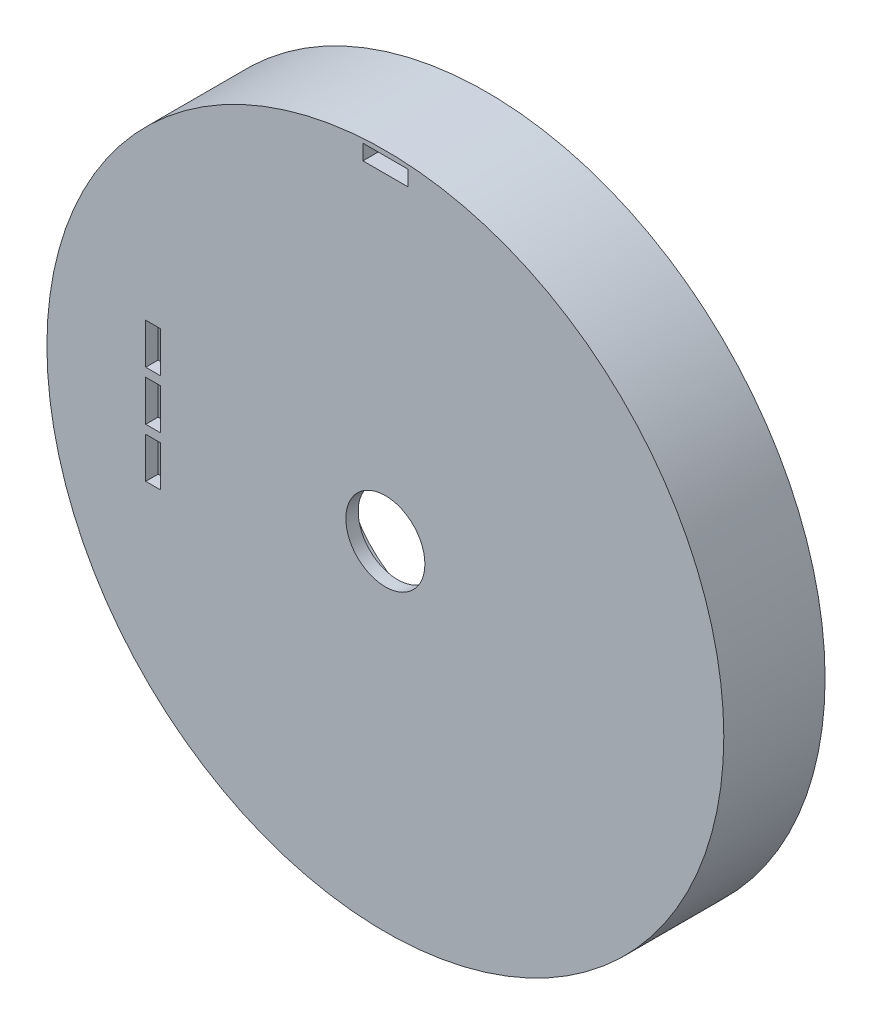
from build123d import *

# Parameters (mm, degrees)
SKICA1_R                      = 137
SKICA1_R_2                    = 16
P_IDAT_VYSUNUT_M1_DEPTH       = 5
P_IDAT_START                  = 36
SKICA4_R                      = 137
SKICA4_R_2                    = 122.5
P_IDAT_VYSUNUT_M2_DEPTH       = 36
ODEBRAT_VYSUNUT_M3_DEPTH      = 33.7
ODEBRAT_VYSUNUT_M3_DEPTH_BACK = 73.7
SKICA7_W                      = 18.14
SKICA7_H                      = 6.19
SKICA10_W                     = 6
SKICA10_H                     = 16.5
ODEBRAT_VYSUNUT_M4_DEPTH      = 30
P_IDAT_START_2                = 4.70229
SKICA11_R                     = 126.5
SKICA11_R_2                   = 122.5
P_IDAT_VYSUNUT_M3_DEPTH       = 4.70229
SKICA12_R                     = 45
SKICA12_R_2                   = 40
P_IDAT_VYSUNUT_M4_DEPTH       = 18
M_TKO1_SCALE                  = 0.655


with BuildPart() as part:
    # Skica1 → P_idat vysunut_m1 (new body)
    with BuildSketch(Plane.XY):
        Circle(SKICA1_R)
        Circle(SKICA1_R_2, mode=Mode.SUBTRACT)
    extrude(amount=P_IDAT_VYSUNUT_M1_DEPTH)

    # Skica4 → P_idat vysunut_m2 (add)
    with BuildSketch(Plane(origin=(0, 0, 0), x_dir=(-1, 0, 0), z_dir=(0, 0, -1)).offset(P_IDAT_START)):
        Circle(SKICA4_R)
        Circle(SKICA4_R_2, mode=Mode.SUBTRACT)
    extrude(amount=-P_IDAT_VYSUNUT_M2_DEPTH)

    # Skica7 → Odebrat vysunut_m3 (cut, two sides: drawn at the far end of the back side and taken through both)
    with BuildSketch(Plane.XY.offset(-ODEBRAT_VYSUNUT_M3_DEPTH_BACK)):
        with Locations((0, 131.905)):
            Rectangle(SKICA7_W, SKICA7_H)
    extrude(amount=ODEBRAT_VYSUNUT_M3_DEPTH + ODEBRAT_VYSUNUT_M3_DEPTH_BACK, mode=Mode.SUBTRACT)

    # Skica10 → Odebrat vysunut_m4 (cut)
    with BuildSketch(Plane.XY.offset(5)):
        with Locations((-94, -19.25)):
            Rectangle(SKICA10_W, SKICA10_H)
        Polygon((-97, 9), (-97, 0), (-97, -7.5), (-91, -7.5), (-91, 0), (-91, 9), align=None)
        with Locations((-94, 20.75)):
            Rectangle(SKICA10_W, SKICA10_H)
    extrude(amount=-ODEBRAT_VYSUNUT_M4_DEPTH, mode=Mode.SUBTRACT)

    # Skica11 → P_idat vysunut_m3 (add)
    with BuildSketch(Plane(origin=(0, 0, -36), x_dir=(-1, 0, 0), z_dir=(0, 0, -1)).offset(P_IDAT_START_2)):
        with Locations(Location((0, 0, 0), (0, 0, 180))):
            Circle(SKICA11_R)
        Circle(SKICA11_R_2, mode=Mode.SUBTRACT)
    extrude(amount=-P_IDAT_VYSUNUT_M3_DEPTH)

    # Skica12 → P_idat vysunut_m4 (add)
    with BuildSketch(Plane(origin=(0, 0, 0), x_dir=(-1, 0, 0), z_dir=(0, 0, -1))):
        with Locations(Location((0, 0, 0), (0, 0, 180))):
            Circle(SKICA12_R)
        Circle(SKICA12_R_2, mode=Mode.SUBTRACT)
    extrude(amount=P_IDAT_VYSUNUT_M4_DEPTH)


with BuildPart() as part_1:
    # M_tko1: scaled about (0, 0, 0)
    add(part.part.scale(M_TKO1_SCALE))


solid = part_1.part
